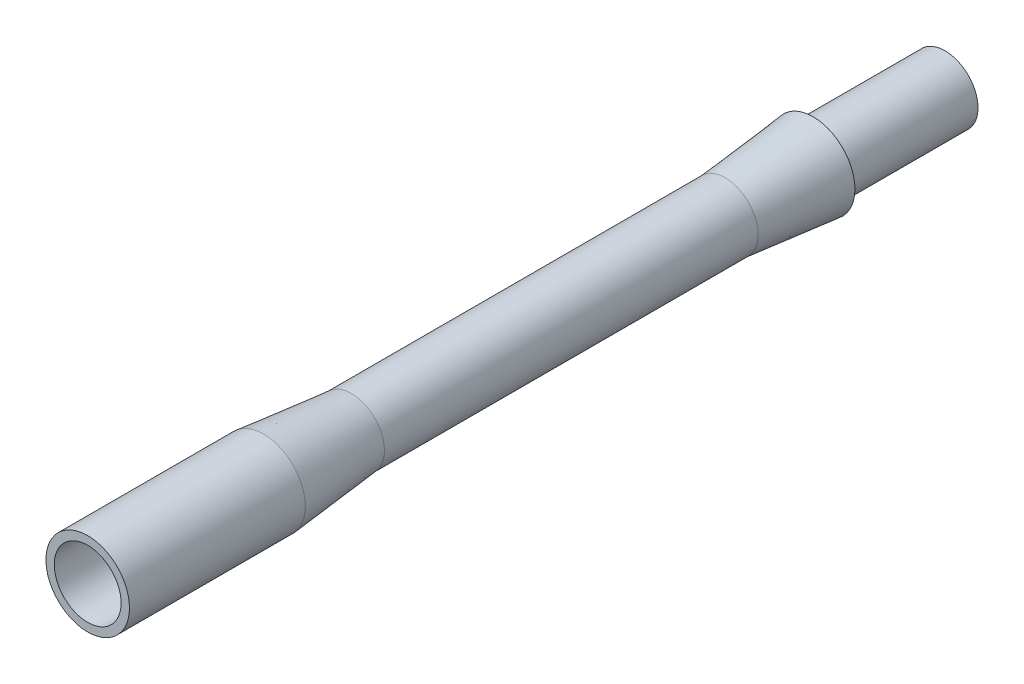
from build123d import *

# Parameters (mm, degrees)
SKETCH1_R           = 9.5
SKETCH1_R_2         = 7.6
BOSS_EXTRUDE1_DEPTH = 40
SKETCH2_R           = 7.5
SKETCH2_R_2         = 6.5
BOSS_EXTRUDE2_DEPTH = 125
BOSS_EXTRUDE3_START = -125
SKETCH4_R           = 6.500000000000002
SKETCH4_R_2         = 5.75
BOSS_EXTRUDE3_DEPTH = 125
SKETCH5_R           = 7.500000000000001
SKETCH5_R_2         = 5.75
BOSS_EXTRUDE4_DEPTH = 30


with BuildPart() as part:
    # Sketch1 → Boss-Extrude1 (new body)
    with BuildSketch(Plane.XY):
        Circle(SKETCH1_R)
        Circle(SKETCH1_R_2, mode=Mode.SUBTRACT)
    extrude(amount=-BOSS_EXTRUDE1_DEPTH)



with BuildPart() as body_2:
    # Sketch2 → Boss-Extrude2 (new body)
    with BuildSketch(Plane(origin=(0, 0, -40), x_dir=(-1, 0, 0), z_dir=(0, 0, -1))):
        Circle(SKETCH2_R)
        Circle(SKETCH2_R_2, mode=Mode.SUBTRACT)
    extrude(amount=BOSS_EXTRUDE2_DEPTH)


with BuildPart() as part_1:
    add(part.part)

    add(body_2.part)  # Revolve1 merges body 2
    # Sketch3 → Revolve1 (revolve)
    with BuildSketch(Plane(origin=(0, 0, 0), x_dir=(0, 0, -1), z_dir=(1, 0, 0)), mode=Mode.PRIVATE) as revolve1_sk:
        Polygon((40.00000000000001, 7.5), (40, 9.5), (60, 7.5), align=None)
    revolve(revolve1_sk.sketch.rotate(Axis((0, 0, -40), (0, 0, -1)), 90), axis=Axis((0, 0, -40), (0, 0, -1)))

    # Sketch4 → Boss-Extrude3 (add)
    with BuildSketch(Plane(origin=(0, 0, -165), x_dir=(-1, 0, 0), z_dir=(0, 0, -1)).offset(BOSS_EXTRUDE3_START)):
        Circle(SKETCH4_R)
        Circle(SKETCH4_R_2, mode=Mode.SUBTRACT)
    extrude(amount=BOSS_EXTRUDE3_DEPTH)

    # Sketch5 → Boss-Extrude4 (add)
    with BuildSketch(Plane(origin=(0, 0, -165), x_dir=(-1, 0, 0), z_dir=(0, 0, -1))):
        with Locations(Location((0, 0, 0), (0, 0, 180))):
            Circle(SKETCH5_R)
        Circle(SKETCH5_R_2, mode=Mode.SUBTRACT)
    extrude(amount=BOSS_EXTRUDE4_DEPTH)

    # Sketch6 → Revolve2 (revolve)
    with BuildSketch(Plane(origin=(0, 0, 0), x_dir=(0, 0, -1), z_dir=(1, 0, 0))):
        Polygon((165, 7.5), (165, 9.5), (145.00000000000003, 7.5), align=None)
    revolve(axis=Axis((0, -1.73e-15, -195), (0, 1.8e-16, 1)))

    # Sketch7 → Revolve3 (revolve)
    with BuildSketch(Plane(origin=(0, 0, 0), x_dir=(0, 0, -1), z_dir=(1, 0, 0)), mode=Mode.PRIVATE) as revolve3_sk:
        Polygon((38.149999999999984, 7.6), (40, 7.6), (40.00000000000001, 5.75), align=None)
    revolve(revolve3_sk.sketch.rotate(Axis((0, 0, -40), (0, 0, 1)), 270), axis=Axis((0, 0, -40), (0, 0, 1)))


solid = part_1.part
